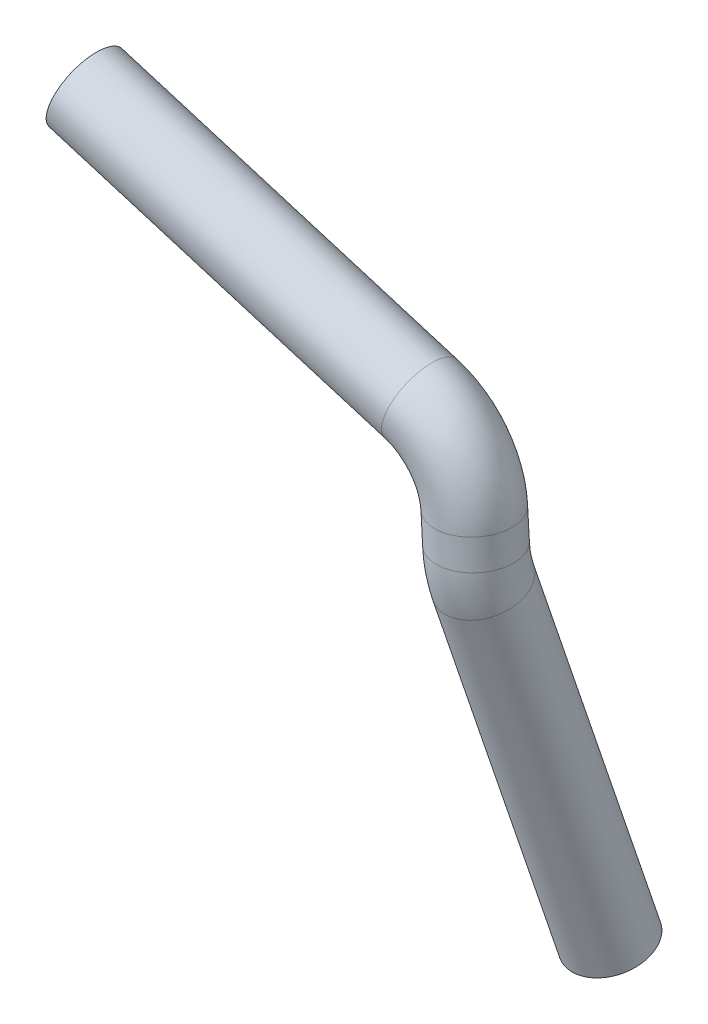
ISO-10303-21;
HEADER;
FILE_DESCRIPTION(('STEP AP214'),'2;1');
FILE_NAME('part.step','',(''),(''),'','','');
FILE_SCHEMA(('AUTOMOTIVE_DESIGN { 1 0 10303 214 1 1 1 1 }'));
ENDSEC;
DATA;
#1=APPLICATION_CONTEXT('core data for automotive mechanical design processes');
#2=APPLICATION_PROTOCOL_DEFINITION('international standard','automotive_design',2000,#1);
#3=PRODUCT_CONTEXT('',#1,'mechanical');
#4=PRODUCT('Part','Part','',(#3));
#5=PRODUCT_RELATED_PRODUCT_CATEGORY('part','',(#4));
#6=PRODUCT_DEFINITION_FORMATION('','',#4);
#7=PRODUCT_DEFINITION_CONTEXT('part definition',#1,'design');
#8=PRODUCT_DEFINITION('design','',#6,#7);
#9=PRODUCT_DEFINITION_SHAPE('','',#8);
#10=(LENGTH_UNIT() NAMED_UNIT(*) SI_UNIT(.MILLI.,.METRE.));
#11=(NAMED_UNIT(*) PLANE_ANGLE_UNIT() SI_UNIT($,.RADIAN.));
#12=(NAMED_UNIT(*) SI_UNIT($,.STERADIAN.) SOLID_ANGLE_UNIT());
#13=UNCERTAINTY_MEASURE_WITH_UNIT(LENGTH_MEASURE(1.E-05),#10,'distance_accuracy_value','');
#14=(GEOMETRIC_REPRESENTATION_CONTEXT(3) GLOBAL_UNCERTAINTY_ASSIGNED_CONTEXT((#13)) GLOBAL_UNIT_ASSIGNED_CONTEXT((#10,
#11,#12)) REPRESENTATION_CONTEXT('',''));
#15=CARTESIAN_POINT('',(0.,0.,0.));
#16=DIRECTION('',(0.,0.,1.));
#17=DIRECTION('',(1.,0.,0.));
#18=AXIS2_PLACEMENT_3D('',#15,#16,#17);
#19=CARTESIAN_POINT('',(-22.3118402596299,46.0239885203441,0.));
#20=DIRECTION('',(-0.957126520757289,0.289670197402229,0.));
#21=DIRECTION('',(-0.289670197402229,-0.957126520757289,0.));
#22=AXIS2_PLACEMENT_3D('',#19,#20,#21);
#23=CYLINDRICAL_SURFACE('',#22,15.);
#24=CARTESIAN_POINT('',(-22.3118402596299,46.0239885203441,0.));
#25=DIRECTION('',(0.95712652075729,-0.289670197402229,0.));
#26=DIRECTION('',(0.00540280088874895,0.0178519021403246,-0.999826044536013));
#27=AXIS2_PLACEMENT_3D('',#24,#25,#26);
#28=CIRCLE('',#27,15.);
#29=CARTESIAN_POINT('',(-17.9667872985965,60.3808863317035,0.));
#30=VERTEX_POINT('',#29);
#31=EDGE_CURVE('E39',#30,#30,#28,.T.);
#32=ORIENTED_EDGE('',*,*,#31,.F.);
#33=EDGE_LOOP('',(#32));
#34=FACE_BOUND('',#33,.T.);
#35=CARTESIAN_POINT('',(-155.346467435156,86.2863424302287,0.));
#36=DIRECTION('',(0.95712652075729,-0.289670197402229,0.));
#37=DIRECTION('',(0.00540280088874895,0.0178519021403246,-0.999826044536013));
#38=AXIS2_PLACEMENT_3D('',#35,#36,#37);
#39=CIRCLE('',#38,15.);
#40=CARTESIAN_POINT('',(-155.265425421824,86.5541209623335,-14.9973906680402));
#41=VERTEX_POINT('',#40);
#42=EDGE_CURVE('E10',#41,#41,#39,.T.);
#43=ORIENTED_EDGE('',*,*,#42,.T.);
#44=EDGE_LOOP('',(#43));
#45=FACE_BOUND('',#44,.T.);
#46=ADVANCED_FACE('F29',(#34,#45),#23,.T.);
#47=CARTESIAN_POINT('',(-22.3118402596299,46.0239885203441,0.));
#48=DIRECTION('',(-0.957126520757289,0.289670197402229,0.));
#49=DIRECTION('',(-0.289670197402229,-0.957126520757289,0.));
#50=AXIS2_PLACEMENT_3D('',#47,#48,#49);
#51=CYLINDRICAL_SURFACE('',#50,13.);
#52=CARTESIAN_POINT('',(-22.3118402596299,46.0239885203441,0.));
#53=DIRECTION('',(0.95712652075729,-0.289670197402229,0.));
#54=DIRECTION('',(0.00540280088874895,0.0178519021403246,-0.999826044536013));
#55=AXIS2_PLACEMENT_3D('',#52,#53,#54);
#56=CIRCLE('',#55,13.);
#57=CARTESIAN_POINT('',(-18.546127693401,58.4666332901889,0.));
#58=VERTEX_POINT('',#57);
#59=EDGE_CURVE('E43',#58,#58,#56,.T.);
#60=ORIENTED_EDGE('',*,*,#59,.T.);
#61=EDGE_LOOP('',(#60));
#62=FACE_BOUND('',#61,.T.);
#63=CARTESIAN_POINT('',(-155.346467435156,86.2863424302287,0.));
#64=DIRECTION('',(0.95712652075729,-0.289670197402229,0.));
#65=DIRECTION('',(0.00540280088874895,0.0178519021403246,-0.999826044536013));
#66=AXIS2_PLACEMENT_3D('',#63,#64,#65);
#67=CIRCLE('',#66,13.);
#68=CARTESIAN_POINT('',(-155.276231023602,86.5184171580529,-12.9977385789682));
#69=VERTEX_POINT('',#68);
#70=EDGE_CURVE('E35',#69,#69,#67,.T.);
#71=ORIENTED_EDGE('',*,*,#70,.F.);
#72=EDGE_LOOP('',(#71));
#73=FACE_BOUND('',#72,.T.);
#74=ADVANCED_FACE('F98',(#62,#73),#51,.F.);
#75=CARTESIAN_POINT('',(-31.0019461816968,17.3101928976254,0.));
#76=DIRECTION('',(0.,0.,1.));
#77=DIRECTION('',(1.,0.,0.));
#78=AXIS2_PLACEMENT_3D('',#75,#76,#77);
#79=TOROIDAL_SURFACE('',#78,30.,15.);
#80=CARTESIAN_POINT('',(-1.04761304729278,18.9648609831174,0.));
#81=DIRECTION('',(0.0551556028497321,-0.998477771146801,0.));
#82=DIRECTION('',(0.0186231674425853,0.00102873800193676,-0.999826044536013));
#83=AXIS2_PLACEMENT_3D('',#80,#81,#82);
#84=CIRCLE('',#83,15.);
#85=CARTESIAN_POINT('',(13.9295535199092,19.7921950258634,0.));
#86=VERTEX_POINT('',#85);
#87=EDGE_CURVE('E48',#86,#86,#84,.T.);
#88=CARTESIAN_POINT('',(-31.0019461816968,17.3101928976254,0.));
#89=DIRECTION('',(0.,0.,1.));
#90=DIRECTION('',(1.,0.,0.));
#91=AXIS2_PLACEMENT_3D('',#88,#89,#90);
#92=CIRCLE('',#91,45.);
#93=EDGE_CURVE('',#86,#30,#92,.T.);
#94=ORIENTED_EDGE('',*,*,#87,.F.);
#95=ORIENTED_EDGE('',*,*,#31,.T.);
#96=ORIENTED_EDGE('',*,*,#93,.T.);
#97=ORIENTED_EDGE('',*,*,#93,.F.);
#98=EDGE_LOOP('',(#94,#96,#95,#97));
#99=FACE_BOUND('',#98,.T.);
#100=ADVANCED_FACE('F103',(#99),#79,.T.);
#101=CARTESIAN_POINT('',(-31.0019461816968,17.3101928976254,0.));
#102=DIRECTION('',(0.,0.,1.));
#103=DIRECTION('',(1.,0.,0.));
#104=AXIS2_PLACEMENT_3D('',#101,#102,#103);
#105=TOROIDAL_SURFACE('',#104,30.,13.);
#106=CARTESIAN_POINT('',(-1.04761304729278,18.9648609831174,0.));
#107=DIRECTION('',(0.0551556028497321,-0.998477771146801,0.));
#108=DIRECTION('',(0.0186231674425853,0.00102873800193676,-0.999826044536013));
#109=AXIS2_PLACEMENT_3D('',#106,#107,#108);
#110=CIRCLE('',#109,13.);
#111=CARTESIAN_POINT('',(11.9325979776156,19.6818838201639,0.));
#112=VERTEX_POINT('',#111);
#113=EDGE_CURVE('E51',#112,#112,#110,.T.);
#114=CARTESIAN_POINT('',(-31.0019461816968,17.3101928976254,0.));
#115=DIRECTION('',(0.,0.,1.));
#116=DIRECTION('',(1.,0.,0.));
#117=AXIS2_PLACEMENT_3D('',#114,#115,#116);
#118=CIRCLE('',#117,43.);
#119=EDGE_CURVE('',#112,#58,#118,.T.);
#120=ORIENTED_EDGE('',*,*,#113,.T.);
#121=ORIENTED_EDGE('',*,*,#59,.F.);
#122=ORIENTED_EDGE('',*,*,#119,.T.);
#123=ORIENTED_EDGE('',*,*,#119,.F.);
#124=EDGE_LOOP('',(#120,#122,#121,#123));
#125=FACE_BOUND('',#124,.T.);
#126=ADVANCED_FACE('F108',(#125),#105,.F.);
#127=CARTESIAN_POINT('',(-0.387970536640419,7.02340173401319,0.));
#128=DIRECTION('',(-0.0551556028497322,0.9984777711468,0.));
#129=DIRECTION('',(-0.998477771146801,-0.0551556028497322,0.));
#130=AXIS2_PLACEMENT_3D('',#127,#128,#129);
#131=CYLINDRICAL_SURFACE('',#130,15.);
#132=CARTESIAN_POINT('',(-0.387970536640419,7.02340173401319,0.));
#133=DIRECTION('',(0.0551556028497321,-0.998477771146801,0.));
#134=DIRECTION('',(0.0186231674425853,0.00102873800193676,-0.999826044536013));
#135=AXIS2_PLACEMENT_3D('',#132,#133,#134);
#136=CIRCLE('',#135,15.);
#137=CARTESIAN_POINT('',(-1.72197957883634,6.94971148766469,14.9403811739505));
#138=VERTEX_POINT('',#137);
#139=EDGE_CURVE('E54',#138,#138,#136,.T.);
#140=ORIENTED_EDGE('',*,*,#139,.F.);
#141=EDGE_LOOP('',(#140));
#142=FACE_BOUND('',#141,.T.);
#143=ORIENTED_EDGE('',*,*,#87,.T.);
#144=EDGE_LOOP('',(#143));
#145=FACE_BOUND('',#144,.T.);
#146=ADVANCED_FACE('F114',(#142,#145),#131,.T.);
#147=CARTESIAN_POINT('',(-0.387970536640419,7.02340173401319,0.));
#148=DIRECTION('',(-0.0551556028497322,0.9984777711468,0.));
#149=DIRECTION('',(-0.998477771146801,-0.0551556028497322,0.));
#150=AXIS2_PLACEMENT_3D('',#147,#148,#149);
#151=CYLINDRICAL_SURFACE('',#150,13.);
#152=CARTESIAN_POINT('',(-0.387970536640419,7.02340173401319,0.));
#153=DIRECTION('',(0.0551556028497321,-0.998477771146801,0.));
#154=DIRECTION('',(0.0186231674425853,0.00102873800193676,-0.999826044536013));
#155=AXIS2_PLACEMENT_3D('',#152,#153,#154);
#156=CIRCLE('',#155,13.);
#157=CARTESIAN_POINT('',(-1.54411170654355,6.95953685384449,12.9483303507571));
#158=VERTEX_POINT('',#157);
#159=EDGE_CURVE('E57',#158,#158,#156,.T.);
#160=ORIENTED_EDGE('',*,*,#159,.T.);
#161=EDGE_LOOP('',(#160));
#162=FACE_BOUND('',#161,.T.);
#163=ORIENTED_EDGE('',*,*,#113,.F.);
#164=EDGE_LOOP('',(#163));
#165=FACE_BOUND('',#164,.T.);
#166=ADVANCED_FACE('F121',(#162,#165),#151,.F.);
#167=CARTESIAN_POINT('',(4.05872627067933,7.26903588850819,-49.8012705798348));
#168=DIRECTION('',(-0.994509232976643,-0.0549363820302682,-0.0890695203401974));
#169=DIRECTION('',(-0.0892042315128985,0.,0.996013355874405));
#170=AXIS2_PLACEMENT_3D('',#167,#168,#169);
#171=TOROIDAL_SURFACE('',#170,50.,15.);
#172=CARTESIAN_POINT('',(0.545508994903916,-6.74125590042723,-1.93302402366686));
#173=DIRECTION('',(0.077551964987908,-0.958366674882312,-0.274807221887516));
#174=DIRECTION('',(0.,0.275637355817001,-0.961261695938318));
#175=AXIS2_PLACEMENT_3D('',#172,#173,#174);
#176=CIRCLE('',#175,15.);
#177=CARTESIAN_POINT('',(-0.508456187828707,-10.9443434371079,12.4274499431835));
#178=VERTEX_POINT('',#177);
#179=EDGE_CURVE('E60',#178,#178,#176,.T.);
#180=CARTESIAN_POINT('',(4.05872627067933,7.26903588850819,-49.8012705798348));
#181=DIRECTION('',(-0.994509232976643,-0.0549363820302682,-0.0890695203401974));
#182=DIRECTION('',(-0.0892042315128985,0.,0.996013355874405));
#183=AXIS2_PLACEMENT_3D('',#180,#181,#182);
#184=CIRCLE('',#183,65.);
#185=EDGE_CURVE('',#178,#138,#184,.T.);
#186=ORIENTED_EDGE('',*,*,#179,.F.);
#187=ORIENTED_EDGE('',*,*,#139,.T.);
#188=ORIENTED_EDGE('',*,*,#185,.T.);
#189=ORIENTED_EDGE('',*,*,#185,.F.);
#190=EDGE_LOOP('',(#186,#188,#187,#189));
#191=FACE_BOUND('',#190,.T.);
#192=ADVANCED_FACE('F125',(#191),#171,.T.);
#193=CARTESIAN_POINT('',(4.05872627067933,7.26903588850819,-49.8012705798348));
#194=DIRECTION('',(-0.994509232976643,-0.0549363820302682,-0.0890695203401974));
#195=DIRECTION('',(-0.0892042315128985,0.,0.996013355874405));
#196=AXIS2_PLACEMENT_3D('',#193,#194,#195);
#197=TOROIDAL_SURFACE('',#196,50.,13.);
#198=CARTESIAN_POINT('',(0.545508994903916,-6.74125590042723,-1.93302402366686));
#199=DIRECTION('',(0.077551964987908,-0.958366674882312,-0.274807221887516));
#200=DIRECTION('',(0.,0.275637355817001,-0.961261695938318));
#201=AXIS2_PLACEMENT_3D('',#198,#199,#200);
#202=CIRCLE('',#201,13.);
#203=CARTESIAN_POINT('',(-0.367927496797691,-10.3839317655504,10.5127200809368));
#204=VERTEX_POINT('',#203);
#205=EDGE_CURVE('E64',#204,#204,#202,.T.);
#206=CARTESIAN_POINT('',(4.05872627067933,7.26903588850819,-49.8012705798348));
#207=DIRECTION('',(-0.994509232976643,-0.0549363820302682,-0.0890695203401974));
#208=DIRECTION('',(-0.0892042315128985,0.,0.996013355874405));
#209=AXIS2_PLACEMENT_3D('',#206,#207,#208);
#210=CIRCLE('',#209,63.);
#211=EDGE_CURVE('',#204,#158,#210,.T.);
#212=ORIENTED_EDGE('',*,*,#205,.T.);
#213=ORIENTED_EDGE('',*,*,#159,.F.);
#214=ORIENTED_EDGE('',*,*,#211,.T.);
#215=ORIENTED_EDGE('',*,*,#211,.F.);
#216=EDGE_LOOP('',(#212,#214,#213,#215));
#217=FACE_BOUND('',#216,.T.);
#218=ADVANCED_FACE('F73',(#217),#197,.F.);
#219=CARTESIAN_POINT('',(0.545508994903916,-6.74125590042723,-1.93302402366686));
#220=DIRECTION('',(0.077551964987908,-0.958366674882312,-0.274807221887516));
#221=DIRECTION('',(0.,0.275637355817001,-0.961261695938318));
#222=AXIS2_PLACEMENT_3D('',#219,#220,#221);
#223=CYLINDRICAL_SURFACE('',#222,13.);
#224=ORIENTED_EDGE('',*,*,#205,.F.);
#225=EDGE_LOOP('',(#224));
#226=FACE_BOUND('',#225,.T.);
#227=CARTESIAN_POINT('',(11.6327947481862,-143.755001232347,-41.2210832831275));
#228=DIRECTION('',(0.077551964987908,-0.958366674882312,-0.274807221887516));
#229=DIRECTION('',(0.,0.275637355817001,-0.961261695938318));
#230=AXIS2_PLACEMENT_3D('',#227,#228,#229);
#231=CIRCLE('',#230,13.);
#232=CARTESIAN_POINT('',(11.6327947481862,-140.171715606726,-53.7174853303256));
#233=VERTEX_POINT('',#232);
#234=EDGE_CURVE('E65',#233,#233,#231,.T.);
#235=ORIENTED_EDGE('',*,*,#234,.T.);
#236=EDGE_LOOP('',(#235));
#237=FACE_BOUND('',#236,.T.);
#238=ADVANCED_FACE('F76',(#226,#237),#223,.F.);
#239=CARTESIAN_POINT('',(0.545508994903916,-6.74125590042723,-1.93302402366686));
#240=DIRECTION('',(0.077551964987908,-0.958366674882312,-0.274807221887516));
#241=DIRECTION('',(0.,0.275637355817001,-0.961261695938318));
#242=AXIS2_PLACEMENT_3D('',#239,#240,#241);
#243=CYLINDRICAL_SURFACE('',#242,15.);
#244=ORIENTED_EDGE('',*,*,#179,.T.);
#245=EDGE_LOOP('',(#244));
#246=FACE_BOUND('',#245,.T.);
#247=CARTESIAN_POINT('',(11.6327947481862,-143.755001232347,-41.2210832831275));
#248=DIRECTION('',(0.077551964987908,-0.958366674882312,-0.274807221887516));
#249=DIRECTION('',(0.,0.275637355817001,-0.961261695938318));
#250=AXIS2_PLACEMENT_3D('',#247,#248,#249);
#251=CIRCLE('',#250,15.);
#252=CARTESIAN_POINT('',(11.6327947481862,-139.620440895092,-55.6400087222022));
#253=VERTEX_POINT('',#252);
#254=EDGE_CURVE('E61',#253,#253,#251,.T.);
#255=ORIENTED_EDGE('',*,*,#254,.F.);
#256=EDGE_LOOP('',(#255));
#257=FACE_BOUND('',#256,.T.);
#258=ADVANCED_FACE('F79',(#246,#257),#243,.T.);
#259=CARTESIAN_POINT('',(-155.346467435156,86.2863424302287,0.));
#260=DIRECTION('',(0.95712652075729,-0.289670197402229,0.));
#261=DIRECTION('',(0.00540280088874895,0.0178519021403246,-0.999826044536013));
#262=AXIS2_PLACEMENT_3D('',#259,#260,#261);
#263=PLANE('',#262);
#264=ORIENTED_EDGE('',*,*,#70,.T.);
#265=EDGE_LOOP('',(#264));
#266=FACE_BOUND('',#265,.T.);
#267=ORIENTED_EDGE('',*,*,#42,.F.);
#268=EDGE_LOOP('',(#267));
#269=FACE_BOUND('',#268,.T.);
#270=ADVANCED_FACE('F86',(#266,#269),#263,.F.);
#271=CARTESIAN_POINT('',(11.6327947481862,-143.755001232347,-41.2210832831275));
#272=DIRECTION('',(0.077551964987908,-0.958366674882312,-0.274807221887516));
#273=DIRECTION('',(0.,0.275637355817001,-0.961261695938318));
#274=AXIS2_PLACEMENT_3D('',#271,#272,#273);
#275=PLANE('',#274);
#276=ORIENTED_EDGE('',*,*,#234,.F.);
#277=EDGE_LOOP('',(#276));
#278=FACE_BOUND('',#277,.T.);
#279=ORIENTED_EDGE('',*,*,#254,.T.);
#280=EDGE_LOOP('',(#279));
#281=FACE_BOUND('',#280,.T.);
#282=ADVANCED_FACE('F83',(#278,#281),#275,.T.);
#283=CLOSED_SHELL('',(#46,#74,#100,#126,#146,#166,#192,#218,#238,#258,#270,#282));
#284=MANIFOLD_SOLID_BREP('B2',#283);
#285=ADVANCED_BREP_SHAPE_REPRESENTATION('',(#18,#284),#14);
#286=SHAPE_DEFINITION_REPRESENTATION(#9,#285);
ENDSEC;
END-ISO-10303-21;
